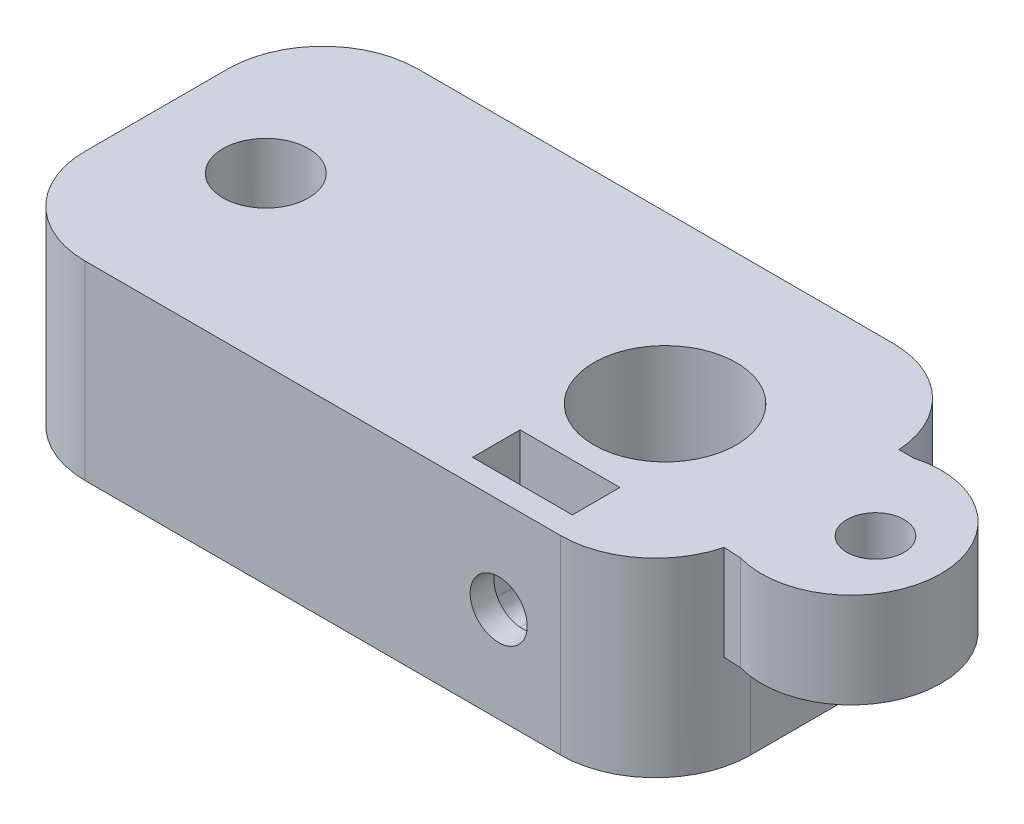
from build123d import *

# Parameters (mm, degrees)
CROQUIS1_W                 = 70
CROQUIS1_H                 = 35
CROQUIS1_R                 = 7.5
SALIENTE_EXTRUIR1_DEPTH    = 20
CROQUIS2_W                 = 13
CROQUIS2_H                 = 6
CORTAR_EXTRUIR1_DEPTH      = 14
CROQUIS3_R                 = 4.5
CORTAR_EXTRUIR2_DEPTH      = 27
REDONDEO1_R                = 10
CORTAR_EXTRUIR3_REACH      = 109.249
CORTAR_EXTRUIR3_END_RADIUS = 7.5
CROQUIS4_R                 = 3
CROQUIS5_W                 = 10.5
CROQUIS5_H                 = 5
CORTAR_EXTRUIR4_DEPTH      = 16
REDONDEO2_R                = 2
CROQUIS6_R                 = 3
SALIENTE_EXTRUIR2_DEPTH    = 10


with BuildPart() as part:
    # Croquis1 → Saliente-Extruir1 (new body)
    with BuildSketch(Plane(origin=(0, 0, 0), x_dir=(1, 0, 0), z_dir=(0, 1, 0))):
        with Locations((-64.385337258, 48)):
            Rectangle(CROQUIS1_W, CROQUIS1_H)
        with Locations(Location((-45.885337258, 48, 0), (0, 0, 270))):
            Circle(CROQUIS1_R, mode=Mode.SUBTRACT)
    extrude(amount=SALIENTE_EXTRUIR1_DEPTH)

    # Croquis2 → Cortar-Extruir1 (cut)
    with BuildSketch(Plane.ZY.offset(99.385337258)):
        with Locations((-48, 10)):
            Rectangle(CROQUIS2_W, CROQUIS2_H)
    extrude(amount=-CORTAR_EXTRUIR1_DEPTH, mode=Mode.SUBTRACT)

    # Croquis3 → Cortar-Extruir2 (cut)
    with BuildSketch(Plane(origin=(0, 20, 0), x_dir=(1, 0, 0), z_dir=(0, 1, 0))):
        with Locations(Location((-87.885337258, 48, 0), (0, 0, 270))):
            Circle(CROQUIS3_R)
    extrude(amount=-CORTAR_EXTRUIR2_DEPTH, mode=Mode.SUBTRACT)

    # Redondeo1
    redondeo1_edges = [part.edges().sort_by_distance(p)[0] for p in [
        (-29.385337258, 10, -30.5),
        (-99.385337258, 10, -30.5),
        (-99.385337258, 10, -65.5),
        (-29.385337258, 10, -65.5),
    ]]
    fillet(redondeo1_edges, radius=REDONDEO1_R)

    # Cortar-Extruir3: up to this cylinder (the profile starts outside it)
    cortar_extruir3_end = Plane(origin=(-45.885337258, 10, -48), z_dir=(0, -1, 0)) * Cylinder(CORTAR_EXTRUIR3_END_RADIUS, 234.498, mode=Mode.PRIVATE)
    # Croquis4 → Cortar-Extruir3 (cut, up to the surface)
    with BuildSketch(Plane.XY.offset(-30.5), mode=Mode.PRIVATE) as cortar_extruir3_sk1:
        with Locations((-45.885337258, 10)):
            Circle(CROQUIS4_R)
    cortar_extruir3_tool1 = extrude(cortar_extruir3_sk1.sketch, amount=-CORTAR_EXTRUIR3_REACH, mode=Mode.PRIVATE) - cortar_extruir3_end
    add(cortar_extruir3_tool1.solids().sort_by_distance((-45.885337, 10, -30.5))[0], mode=Mode.SUBTRACT)

    # Croquis5 → Cortar-Extruir4 (cut)
    with BuildSketch(Plane(origin=(0, 20, 0), x_dir=(1, 0, 0), z_dir=(0, 1, 0))):
        with Locations((-45.885337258, 35.5)):
            Rectangle(CROQUIS5_W, CROQUIS5_H)
    extrude(amount=-CORTAR_EXTRUIR4_DEPTH, mode=Mode.SUBTRACT)

    # Redondeo2
    redondeo2_edges = [part.edges().sort_by_distance(p)[0] for p in [
        (-51.135337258, 4, -35.5),
        (-40.635337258, 4, -35.5),
    ]]
    fillet(redondeo2_edges, radius=REDONDEO2_R)

    # Croquis6 → Saliente-Extruir2 (add)
    with BuildSketch(Plane(origin=(0, 20, 0), x_dir=(1, 0, 0), z_dir=(0, 1, 0))):
        with BuildLine():
            Line((-27.885337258, 37.926420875), (-29.697570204, 38.020651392))
            ThreePointArc((-29.697570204, 38.020651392), (-29.46370255, 39.250534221), (-29.385337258, 40.5))
            Line((-29.385337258, 40.5), (-29.385337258, 55.5))
            ThreePointArc((-29.385337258, 55.5), (-29.390210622, 55.812159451), (-29.404825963, 56.12401465))
            Line((-29.404825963, 56.12401465), (-27.885337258, 56.12401465))
            ThreePointArc((-27.885337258, 56.12401465), (-15.890181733, 47.025217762), (-27.885337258, 37.926420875))
        make_face()
        with Locations(Location((-22.775622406, 47.025217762, 0), (0, 0, 270))):
            Circle(CROQUIS6_R, mode=Mode.SUBTRACT)
    extrude(amount=-SALIENTE_EXTRUIR2_DEPTH)


solid = part.part
